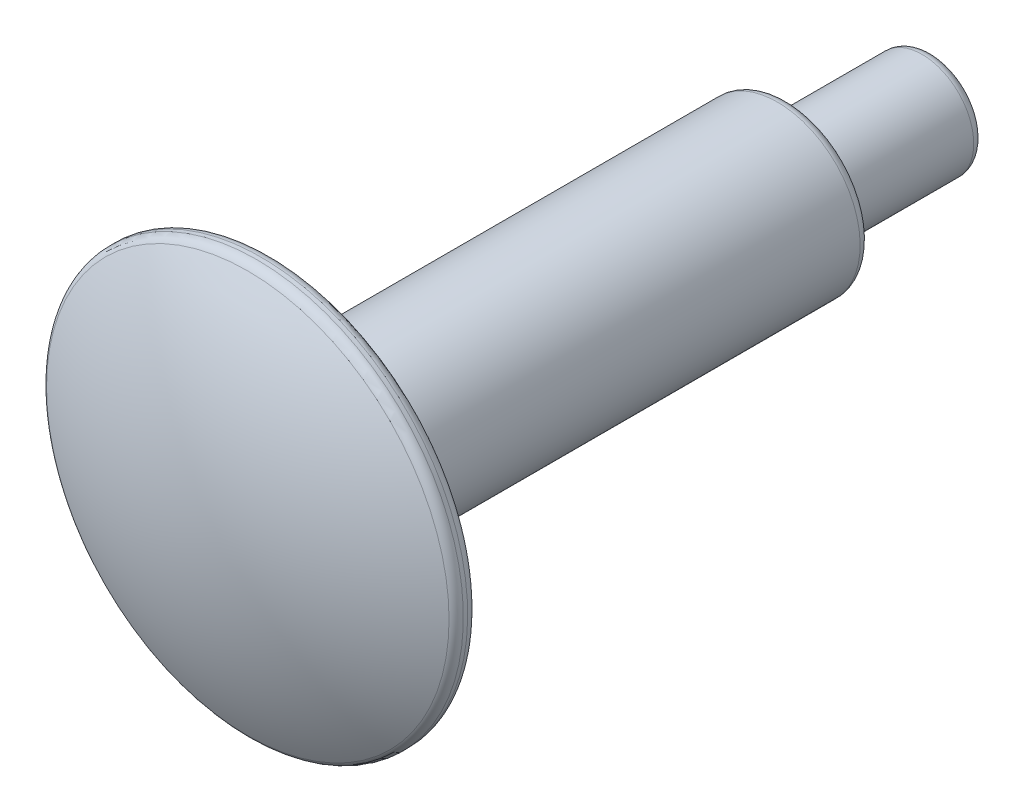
ISO-10303-21;
HEADER;
FILE_DESCRIPTION(('STEP AP214'),'2;1');
FILE_NAME('part.step','',(''),(''),'','','');
FILE_SCHEMA(('AUTOMOTIVE_DESIGN { 1 0 10303 214 1 1 1 1 }'));
ENDSEC;
DATA;
#1=APPLICATION_CONTEXT('core data for automotive mechanical design processes');
#2=APPLICATION_PROTOCOL_DEFINITION('international standard','automotive_design',2000,#1);
#3=PRODUCT_CONTEXT('',#1,'mechanical');
#4=PRODUCT('Part','Part','',(#3));
#5=PRODUCT_RELATED_PRODUCT_CATEGORY('part','',(#4));
#6=PRODUCT_DEFINITION_FORMATION('','',#4);
#7=PRODUCT_DEFINITION_CONTEXT('part definition',#1,'design');
#8=PRODUCT_DEFINITION('design','',#6,#7);
#9=PRODUCT_DEFINITION_SHAPE('','',#8);
#10=(LENGTH_UNIT() NAMED_UNIT(*) SI_UNIT(.MILLI.,.METRE.));
#11=(NAMED_UNIT(*) PLANE_ANGLE_UNIT() SI_UNIT($,.RADIAN.));
#12=(NAMED_UNIT(*) SI_UNIT($,.STERADIAN.) SOLID_ANGLE_UNIT());
#13=UNCERTAINTY_MEASURE_WITH_UNIT(LENGTH_MEASURE(1.E-05),#10,'distance_accuracy_value','');
#14=(GEOMETRIC_REPRESENTATION_CONTEXT(3) GLOBAL_UNCERTAINTY_ASSIGNED_CONTEXT((#13)) GLOBAL_UNIT_ASSIGNED_CONTEXT((#10,
#11,#12)) REPRESENTATION_CONTEXT('',''));
#15=CARTESIAN_POINT('',(0.,0.,0.));
#16=DIRECTION('',(0.,0.,1.));
#17=DIRECTION('',(1.,0.,0.));
#18=AXIS2_PLACEMENT_3D('',#15,#16,#17);
#19=CARTESIAN_POINT('',(0.,0.,-2.16025403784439));
#20=DIRECTION('',(0.,0.,1.));
#21=DIRECTION('',(0.,1.,0.));
#22=AXIS2_PLACEMENT_3D('',#19,#20,#21);
#23=SPHERICAL_SURFACE('',#22,20.);
#24=CARTESIAN_POINT('',(0.,0.,15.3057832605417));
#25=DIRECTION('',(0.,0.,-1.));
#26=DIRECTION('',(0.,1.,0.));
#27=AXIS2_PLACEMENT_3D('',#24,#25,#26);
#28=CIRCLE('',#27,9.74358974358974);
#29=CARTESIAN_POINT('',(0.,9.74358974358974,15.3057832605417));
#30=VERTEX_POINT('',#29);
#31=EDGE_CURVE('E40',#30,#30,#28,.F.);
#32=ORIENTED_EDGE('',*,*,#31,.T.);
#33=EDGE_LOOP('',(#32));
#34=FACE_BOUND('',#33,.T.);
#35=ADVANCED_FACE('F29',(#34),#23,.T.);
#36=CARTESIAN_POINT('',(0.,0.,-17.8397459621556));
#37=DIRECTION('',(0.,0.,1.));
#38=DIRECTION('',(0.,-1.,0.));
#39=AXIS2_PLACEMENT_3D('',#36,#37,#38);
#40=PLANE('',#39);
#41=CARTESIAN_POINT('',(0.,0.,-17.8397459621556));
#42=DIRECTION('',(0.,0.,1.));
#43=DIRECTION('',(0.,-1.,0.));
#44=AXIS2_PLACEMENT_3D('',#41,#42,#43);
#45=CIRCLE('',#44,2.);
#46=CARTESIAN_POINT('',(0.,-1.99999999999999,-17.8397459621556));
#47=VERTEX_POINT('',#46);
#48=EDGE_CURVE('E64',#47,#47,#45,.F.);
#49=ORIENTED_EDGE('',*,*,#48,.T.);
#50=EDGE_LOOP('',(#49));
#51=FACE_BOUND('',#50,.T.);
#52=ADVANCED_FACE('F122',(#51),#40,.F.);
#53=CARTESIAN_POINT('',(0.,0.,17.8397459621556));
#54=DIRECTION('',(0.,0.,1.));
#55=DIRECTION('',(0.,-1.,0.));
#56=AXIS2_PLACEMENT_3D('',#53,#54,#55);
#57=CYLINDRICAL_SURFACE('',#56,2.5);
#58=CARTESIAN_POINT('',(0.,0.,-17.3397459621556));
#59=DIRECTION('',(0.,0.,1.));
#60=DIRECTION('',(0.,-1.,0.));
#61=AXIS2_PLACEMENT_3D('',#58,#59,#60);
#62=CIRCLE('',#61,2.5);
#63=CARTESIAN_POINT('',(0.,-2.49999999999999,-17.3397459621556));
#64=VERTEX_POINT('',#63);
#65=EDGE_CURVE('E67',#64,#64,#62,.T.);
#66=ORIENTED_EDGE('',*,*,#65,.T.);
#67=EDGE_LOOP('',(#66));
#68=FACE_BOUND('',#67,.T.);
#69=CARTESIAN_POINT('',(0.,0.,-11.3397459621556));
#70=DIRECTION('',(0.,0.,1.));
#71=DIRECTION('',(0.,-1.,0.));
#72=AXIS2_PLACEMENT_3D('',#69,#70,#71);
#73=CIRCLE('',#72,2.5);
#74=CARTESIAN_POINT('',(0.,-2.49999999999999,-11.3397459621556));
#75=VERTEX_POINT('',#74);
#76=EDGE_CURVE('E70',#75,#75,#73,.F.);
#77=ORIENTED_EDGE('',*,*,#76,.T.);
#78=EDGE_LOOP('',(#77));
#79=FACE_BOUND('',#78,.T.);
#80=ADVANCED_FACE('F74',(#68,#79),#57,.T.);
#81=CARTESIAN_POINT('',(0.,2.5,-10.8397459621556));
#82=DIRECTION('',(0.,0.,1.));
#83=DIRECTION('',(0.,-1.,0.));
#84=AXIS2_PLACEMENT_3D('',#81,#82,#83);
#85=PLANE('',#84);
#86=CARTESIAN_POINT('',(0.,0.,-10.8397459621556));
#87=DIRECTION('',(0.,0.,1.));
#88=DIRECTION('',(0.,-1.,0.));
#89=AXIS2_PLACEMENT_3D('',#86,#87,#88);
#90=CIRCLE('',#89,3.);
#91=CARTESIAN_POINT('',(0.,-2.99999999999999,-10.8397459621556));
#92=VERTEX_POINT('',#91);
#93=EDGE_CURVE('E58',#92,#92,#90,.T.);
#94=ORIENTED_EDGE('',*,*,#93,.T.);
#95=EDGE_LOOP('',(#94));
#96=FACE_BOUND('',#95,.T.);
#97=CARTESIAN_POINT('',(0.,0.,-10.8397459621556));
#98=DIRECTION('',(0.,0.,1.));
#99=DIRECTION('',(0.,-1.,0.));
#100=AXIS2_PLACEMENT_3D('',#97,#98,#99);
#101=CIRCLE('',#100,3.5);
#102=CARTESIAN_POINT('',(0.,-3.49999999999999,-10.8397459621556));
#103=VERTEX_POINT('',#102);
#104=EDGE_CURVE('E61',#103,#103,#101,.F.);
#105=ORIENTED_EDGE('',*,*,#104,.T.);
#106=EDGE_LOOP('',(#105));
#107=FACE_BOUND('',#106,.T.);
#108=ADVANCED_FACE('F84',(#96,#107),#85,.F.);
#109=CARTESIAN_POINT('',(0.,0.,17.8397459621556));
#110=DIRECTION('',(0.,0.,1.));
#111=DIRECTION('',(0.,-1.,0.));
#112=AXIS2_PLACEMENT_3D('',#109,#110,#111);
#113=CYLINDRICAL_SURFACE('',#112,4.);
#114=CARTESIAN_POINT('',(0.,0.,-10.3397459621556));
#115=DIRECTION('',(0.,0.,1.));
#116=DIRECTION('',(0.,-1.,0.));
#117=AXIS2_PLACEMENT_3D('',#114,#115,#116);
#118=CIRCLE('',#117,4.);
#119=CARTESIAN_POINT('',(0.,-3.99999999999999,-10.3397459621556));
#120=VERTEX_POINT('',#119);
#121=EDGE_CURVE('E52',#120,#120,#118,.T.);
#122=ORIENTED_EDGE('',*,*,#121,.T.);
#123=EDGE_LOOP('',(#122));
#124=FACE_BOUND('',#123,.T.);
#125=CARTESIAN_POINT('',(0.,0.,13.6602540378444));
#126=DIRECTION('',(0.,0.,1.));
#127=DIRECTION('',(0.,-1.,0.));
#128=AXIS2_PLACEMENT_3D('',#125,#126,#127);
#129=CIRCLE('',#128,4.);
#130=CARTESIAN_POINT('',(0.,-3.99999999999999,13.6602540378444));
#131=VERTEX_POINT('',#130);
#132=EDGE_CURVE('E55',#131,#131,#129,.F.);
#133=ORIENTED_EDGE('',*,*,#132,.T.);
#134=EDGE_LOOP('',(#133));
#135=FACE_BOUND('',#134,.T.);
#136=ADVANCED_FACE('F87',(#124,#135),#113,.T.);
#137=CARTESIAN_POINT('',(0.,4.,14.1602540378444));
#138=DIRECTION('',(0.,0.,1.));
#139=DIRECTION('',(0.,-1.,0.));
#140=AXIS2_PLACEMENT_3D('',#137,#138,#139);
#141=PLANE('',#140);
#142=CARTESIAN_POINT('',(0.,0.,14.1602540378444));
#143=DIRECTION('',(0.,0.,1.));
#144=DIRECTION('',(0.,-1.,0.));
#145=AXIS2_PLACEMENT_3D('',#142,#143,#144);
#146=CIRCLE('',#145,4.5);
#147=CARTESIAN_POINT('',(0.,-4.49999999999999,14.1602540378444));
#148=VERTEX_POINT('',#147);
#149=EDGE_CURVE('E44',#148,#148,#146,.T.);
#150=ORIENTED_EDGE('',*,*,#149,.T.);
#151=EDGE_LOOP('',(#150));
#152=FACE_BOUND('',#151,.T.);
#153=CARTESIAN_POINT('',(0.,0.,14.1602540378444));
#154=DIRECTION('',(0.,0.,1.));
#155=DIRECTION('',(0.,-1.,0.));
#156=AXIS2_PLACEMENT_3D('',#153,#154,#155);
#157=CIRCLE('',#156,9.5);
#158=CARTESIAN_POINT('',(0.,-9.49999999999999,14.1602540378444));
#159=VERTEX_POINT('',#158);
#160=EDGE_CURVE('E49',#159,#159,#157,.F.);
#161=ORIENTED_EDGE('',*,*,#160,.T.);
#162=EDGE_LOOP('',(#161));
#163=FACE_BOUND('',#162,.T.);
#164=ADVANCED_FACE('F99',(#152,#163),#141,.F.);
#165=CARTESIAN_POINT('',(0.,0.,17.8397459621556));
#166=DIRECTION('',(0.,0.,1.));
#167=DIRECTION('',(0.,-1.,0.));
#168=AXIS2_PLACEMENT_3D('',#165,#166,#167);
#169=CYLINDRICAL_SURFACE('',#168,10.);
#170=CARTESIAN_POINT('',(0.,0.,14.869132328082));
#171=DIRECTION('',(0.,0.,-1.));
#172=DIRECTION('',(0.,1.,0.));
#173=AXIS2_PLACEMENT_3D('',#170,#171,#172);
#174=CIRCLE('',#173,10.);
#175=CARTESIAN_POINT('',(0.,10.,14.869132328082));
#176=VERTEX_POINT('',#175);
#177=EDGE_CURVE('E10',#176,#176,#174,.T.);
#178=ORIENTED_EDGE('',*,*,#177,.T.);
#179=EDGE_LOOP('',(#178));
#180=FACE_BOUND('',#179,.T.);
#181=CARTESIAN_POINT('',(0.,0.,14.6602540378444));
#182=DIRECTION('',(0.,0.,1.));
#183=DIRECTION('',(0.,-1.,0.));
#184=AXIS2_PLACEMENT_3D('',#181,#182,#183);
#185=CIRCLE('',#184,10.);
#186=CARTESIAN_POINT('',(0.,-9.99999999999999,14.6602540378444));
#187=VERTEX_POINT('',#186);
#188=EDGE_CURVE('E36',#187,#187,#185,.T.);
#189=ORIENTED_EDGE('',*,*,#188,.T.);
#190=EDGE_LOOP('',(#189));
#191=FACE_BOUND('',#190,.T.);
#192=ADVANCED_FACE('F111',(#180,#191),#169,.T.);
#193=CARTESIAN_POINT('',(0.,0.,-17.3397459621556));
#194=DIRECTION('',(0.,0.,1.));
#195=DIRECTION('',(0.,-1.,0.));
#196=AXIS2_PLACEMENT_3D('',#193,#194,#195);
#197=TOROIDAL_SURFACE('',#196,2.,0.5);
#198=ORIENTED_EDGE('',*,*,#48,.F.);
#199=EDGE_LOOP('',(#198));
#200=FACE_BOUND('',#199,.T.);
#201=ORIENTED_EDGE('',*,*,#65,.F.);
#202=EDGE_LOOP('',(#201));
#203=FACE_BOUND('',#202,.T.);
#204=ADVANCED_FACE('F80',(#200,#203),#197,.T.);
#205=CARTESIAN_POINT('',(0.,0.,-11.3397459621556));
#206=DIRECTION('',(0.,0.,1.));
#207=DIRECTION('',(0.,-1.,0.));
#208=AXIS2_PLACEMENT_3D('',#205,#206,#207);
#209=TOROIDAL_SURFACE('',#208,3.,0.5);
#210=ORIENTED_EDGE('',*,*,#76,.F.);
#211=EDGE_LOOP('',(#210));
#212=FACE_BOUND('',#211,.T.);
#213=ORIENTED_EDGE('',*,*,#93,.F.);
#214=EDGE_LOOP('',(#213));
#215=FACE_BOUND('',#214,.T.);
#216=ADVANCED_FACE('F76',(#212,#215),#209,.F.);
#217=CARTESIAN_POINT('',(0.,0.,-10.3397459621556));
#218=DIRECTION('',(0.,0.,1.));
#219=DIRECTION('',(0.,-1.,0.));
#220=AXIS2_PLACEMENT_3D('',#217,#218,#219);
#221=TOROIDAL_SURFACE('',#220,3.5,0.5);
#222=ORIENTED_EDGE('',*,*,#104,.F.);
#223=EDGE_LOOP('',(#222));
#224=FACE_BOUND('',#223,.T.);
#225=ORIENTED_EDGE('',*,*,#121,.F.);
#226=EDGE_LOOP('',(#225));
#227=FACE_BOUND('',#226,.T.);
#228=ADVANCED_FACE('F79',(#224,#227),#221,.T.);
#229=CARTESIAN_POINT('',(0.,0.,13.6602540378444));
#230=DIRECTION('',(0.,0.,1.));
#231=DIRECTION('',(0.,-1.,0.));
#232=AXIS2_PLACEMENT_3D('',#229,#230,#231);
#233=TOROIDAL_SURFACE('',#232,4.5,0.5);
#234=ORIENTED_EDGE('',*,*,#132,.F.);
#235=EDGE_LOOP('',(#234));
#236=FACE_BOUND('',#235,.T.);
#237=ORIENTED_EDGE('',*,*,#149,.F.);
#238=EDGE_LOOP('',(#237));
#239=FACE_BOUND('',#238,.T.);
#240=ADVANCED_FACE('F93',(#236,#239),#233,.F.);
#241=CARTESIAN_POINT('',(0.,0.,14.869132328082));
#242=DIRECTION('',(0.,0.,-1.));
#243=DIRECTION('',(0.,1.,0.));
#244=AXIS2_PLACEMENT_3D('',#241,#242,#243);
#245=TOROIDAL_SURFACE('',#244,9.5,0.5);
#246=ORIENTED_EDGE('',*,*,#177,.F.);
#247=EDGE_LOOP('',(#246));
#248=FACE_BOUND('',#247,.T.);
#249=ORIENTED_EDGE('',*,*,#31,.F.);
#250=EDGE_LOOP('',(#249));
#251=FACE_BOUND('',#250,.T.);
#252=ADVANCED_FACE('F105',(#248,#251),#245,.T.);
#253=CARTESIAN_POINT('',(0.,0.,14.6602540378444));
#254=DIRECTION('',(0.,0.,1.));
#255=DIRECTION('',(0.,-1.,0.));
#256=AXIS2_PLACEMENT_3D('',#253,#254,#255);
#257=TOROIDAL_SURFACE('',#256,9.5,0.5);
#258=ORIENTED_EDGE('',*,*,#160,.F.);
#259=EDGE_LOOP('',(#258));
#260=FACE_BOUND('',#259,.T.);
#261=ORIENTED_EDGE('',*,*,#188,.F.);
#262=EDGE_LOOP('',(#261));
#263=FACE_BOUND('',#262,.T.);
#264=ADVANCED_FACE('F31',(#260,#263),#257,.T.);
#265=CLOSED_SHELL('',(#35,#52,#80,#108,#136,#164,#192,#204,#216,#228,#240,#252,#264));
#266=MANIFOLD_SOLID_BREP('B2',#265);
#267=ADVANCED_BREP_SHAPE_REPRESENTATION('',(#18,#266),#14);
#268=SHAPE_DEFINITION_REPRESENTATION(#9,#267);
ENDSEC;
END-ISO-10303-21;
